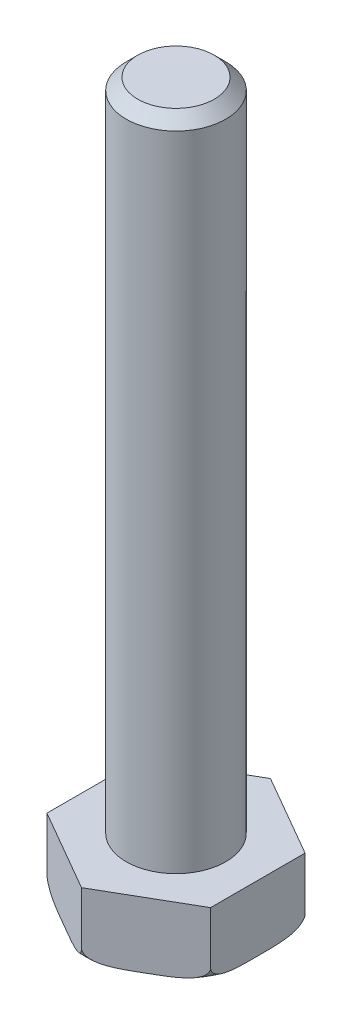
ISO-10303-21;
HEADER;
FILE_DESCRIPTION(('STEP AP214'),'2;1');
FILE_NAME('part.step','',(''),(''),'','','');
FILE_SCHEMA(('AUTOMOTIVE_DESIGN { 1 0 10303 214 1 1 1 1 }'));
ENDSEC;
DATA;
#1=APPLICATION_CONTEXT('core data for automotive mechanical design processes');
#2=APPLICATION_PROTOCOL_DEFINITION('international standard','automotive_design',2000,#1);
#3=PRODUCT_CONTEXT('',#1,'mechanical');
#4=PRODUCT('Part','Part','',(#3));
#5=PRODUCT_RELATED_PRODUCT_CATEGORY('part','',(#4));
#6=PRODUCT_DEFINITION_FORMATION('','',#4);
#7=PRODUCT_DEFINITION_CONTEXT('part definition',#1,'design');
#8=PRODUCT_DEFINITION('design','',#6,#7);
#9=PRODUCT_DEFINITION_SHAPE('','',#8);
#10=(LENGTH_UNIT() NAMED_UNIT(*) SI_UNIT(.MILLI.,.METRE.));
#11=(NAMED_UNIT(*) PLANE_ANGLE_UNIT() SI_UNIT($,.RADIAN.));
#12=(NAMED_UNIT(*) SI_UNIT($,.STERADIAN.) SOLID_ANGLE_UNIT());
#13=UNCERTAINTY_MEASURE_WITH_UNIT(LENGTH_MEASURE(1.E-05),#10,'distance_accuracy_value','');
#14=(GEOMETRIC_REPRESENTATION_CONTEXT(3) GLOBAL_UNCERTAINTY_ASSIGNED_CONTEXT((#13)) GLOBAL_UNIT_ASSIGNED_CONTEXT((#10,
#11,#12)) REPRESENTATION_CONTEXT('',''));
#15=CARTESIAN_POINT('',(0.,0.,0.));
#16=DIRECTION('',(0.,0.,1.));
#17=DIRECTION('',(1.,0.,0.));
#18=AXIS2_PLACEMENT_3D('',#15,#16,#17);
#19=CARTESIAN_POINT('',(0.,-11.3583659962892,19.2633276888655));
#20=DIRECTION('',(0.,1.,0.));
#21=DIRECTION('',(0.,0.,1.));
#22=AXIS2_PLACEMENT_3D('',#19,#20,#21);
#23=PLANE('',#22);
#24=CARTESIAN_POINT('',(0.,-11.3583659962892,23.8460454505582));
#25=DIRECTION('',(0.,-1.,0.));
#26=DIRECTION('',(0.,0.,-1.));
#27=AXIS2_PLACEMENT_3D('',#24,#25,#26);
#28=CIRCLE('',#27,3.94771776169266);
#29=CARTESIAN_POINT('',(0.,-11.3583659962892,19.8983276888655));
#30=VERTEX_POINT('',#29);
#31=EDGE_CURVE('E22',#30,#30,#28,.F.);
#32=ORIENTED_EDGE('',*,*,#31,.F.);
#33=EDGE_LOOP('',(#32));
#34=FACE_BOUND('',#33,.T.);
#35=ADVANCED_FACE('F17',(#34),#23,.F.);
#36=CARTESIAN_POINT('',(0.,-10.7233659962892,23.8460454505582));
#37=DIRECTION('',(0.,-1.,0.));
#38=DIRECTION('',(0.,0.,-1.));
#39=AXIS2_PLACEMENT_3D('',#36,#37,#38);
#40=TOROIDAL_SURFACE('',#39,3.94771776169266,0.635);
#41=CARTESIAN_POINT('',(0.,-10.7233659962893,19.2633276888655));
#42=CARTESIAN_POINT('',(-3.83732688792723E-05,-10.7423802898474,19.2633055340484));
#43=CARTESIAN_POINT('',(0.00147685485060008,-10.7613470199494,19.2641803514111));
#44=CARTESIAN_POINT('',(0.00727990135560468,-10.7985464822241,19.2675307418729));
#45=CARTESIAN_POINT('',(0.0115439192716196,-10.8167841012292,19.2699925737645));
#46=CARTESIAN_POINT('',(0.022504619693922,-10.8521779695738,19.2763207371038));
#47=CARTESIAN_POINT('',(0.0291944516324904,-10.8693371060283,19.2801831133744));
#48=CARTESIAN_POINT('',(0.0445861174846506,-10.9024333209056,19.2890694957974));
#49=CARTESIAN_POINT('',(0.0532924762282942,-10.9183675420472,19.2940961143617));
#50=CARTESIAN_POINT('',(0.0785354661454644,-10.9589030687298,19.3086701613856));
#51=CARTESIAN_POINT('',(0.0964659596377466,-10.982346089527,19.31902233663));
#52=CARTESIAN_POINT('',(0.135238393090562,-11.0257503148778,19.3414076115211));
#53=CARTESIAN_POINT('',(0.156088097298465,-11.0457019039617,19.3534451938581));
#54=CARTESIAN_POINT('',(0.215571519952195,-11.0959638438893,19.3877879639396));
#55=CARTESIAN_POINT('',(0.25610593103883,-11.1232472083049,19.4111905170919));
#56=CARTESIAN_POINT('',(0.340045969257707,-11.1708989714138,19.4596533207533));
#57=CARTESIAN_POINT('',(0.383457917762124,-11.1912514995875,19.4847172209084));
#58=CARTESIAN_POINT('',(0.490169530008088,-11.2340920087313,19.5463271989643));
#59=CARTESIAN_POINT('',(0.554243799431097,-11.2539590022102,19.5833204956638));
#60=CARTESIAN_POINT('',(0.68378244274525,-11.2865374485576,19.6581096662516));
#61=CARTESIAN_POINT('',(0.749249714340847,-11.2992320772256,19.6959072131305));
#62=CARTESIAN_POINT('',(0.881045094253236,-11.3196748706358,19.7719993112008));
#63=CARTESIAN_POINT('',(0.947375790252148,-11.3273997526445,19.8102953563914));
#64=CARTESIAN_POINT('',(1.08027404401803,-11.3394445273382,19.8870241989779));
#65=CARTESIAN_POINT('',(1.14684168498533,-11.3437630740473,19.9254570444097));
#66=CARTESIAN_POINT('',(1.28891257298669,-11.3506527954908,20.0074817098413));
#67=CARTESIAN_POINT('',(1.36442595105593,-11.3529149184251,20.051079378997));
#68=CARTESIAN_POINT('',(1.51548672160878,-11.3559630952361,20.1382943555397));
#69=CARTESIAN_POINT('',(1.59103411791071,-11.3567487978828,20.1819116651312));
#70=CARTESIAN_POINT('',(1.74188055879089,-11.3577102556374,20.2690028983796));
#71=CARTESIAN_POINT('',(1.81717959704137,-11.3578880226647,20.3124768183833));
#72=CARTESIAN_POINT('',(1.96777145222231,-11.3580499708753,20.3994210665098));
#73=CARTESIAN_POINT('',(2.04306426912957,-11.3580341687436,20.4428913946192));
#74=CARTESIAN_POINT('',(2.22049431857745,-11.3577428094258,20.5453306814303));
#75=CARTESIAN_POINT('',(2.32263105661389,-11.3573766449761,20.6042993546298));
#76=CARTESIAN_POINT('',(2.52690364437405,-11.3548434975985,20.7222361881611));
#77=CARTESIAN_POINT('',(2.62903949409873,-11.3526765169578,20.7812043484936));
#78=CARTESIAN_POINT('',(2.80048926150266,-11.3450202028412,20.8801909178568));
#79=CARTESIAN_POINT('',(2.86984168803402,-11.3408167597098,20.9202315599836));
#80=CARTESIAN_POINT('',(3.0084780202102,-11.3288214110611,21.000273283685));
#81=CARTESIAN_POINT('',(3.07776153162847,-11.3210225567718,21.0402741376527));
#82=CARTESIAN_POINT('',(3.18625832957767,-11.3044847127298,21.1029147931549));
#83=CARTESIAN_POINT('',(3.22567711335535,-11.2975696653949,21.1256732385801));
#84=CARTESIAN_POINT('',(3.30416684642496,-11.2815012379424,21.1709893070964));
#85=CARTESIAN_POINT('',(3.34323790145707,-11.2723485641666,21.1935469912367));
#86=CARTESIAN_POINT('',(3.42068899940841,-11.2512872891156,21.238263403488));
#87=CARTESIAN_POINT('',(3.45907093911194,-11.2393881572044,21.2604232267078));
#88=CARTESIAN_POINT('',(3.53488731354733,-11.2121292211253,21.3041958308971));
#89=CARTESIAN_POINT('',(3.57232269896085,-11.1967730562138,21.3258091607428));
#90=CARTESIAN_POINT('',(3.63577808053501,-11.1664072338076,21.3624451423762));
#91=CARTESIAN_POINT('',(3.66216024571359,-11.1524152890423,21.3776768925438));
#92=CARTESIAN_POINT('',(3.71372930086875,-11.121617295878,21.4074503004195));
#93=CARTESIAN_POINT('',(3.73891464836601,-11.1048077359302,21.4219910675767));
#94=CARTESIAN_POINT('',(3.78763446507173,-11.0676926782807,21.4501194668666));
#95=CARTESIAN_POINT('',(3.81115197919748,-11.0473569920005,21.4636973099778));
#96=CARTESIAN_POINT('',(3.85520083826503,-11.0027163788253,21.4891289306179));
#97=CARTESIAN_POINT('',(3.87573886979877,-10.9784206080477,21.5009865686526));
#98=CARTESIAN_POINT('',(3.9052282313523,-10.9355586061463,21.5180122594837));
#99=CARTESIAN_POINT('',(3.91561842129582,-10.9183183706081,21.5240110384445));
#100=CARTESIAN_POINT('',(3.93403687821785,-10.8822736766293,21.5346449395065));
#101=CARTESIAN_POINT('',(3.94207264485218,-10.8634744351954,21.539284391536));
#102=CARTESIAN_POINT('',(3.95508099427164,-10.82492353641,21.546794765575));
#103=CARTESIAN_POINT('',(3.96011259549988,-10.8051990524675,21.5496997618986));
#104=CARTESIAN_POINT('',(3.96699119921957,-10.7648012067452,21.5536711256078));
#105=CARTESIAN_POINT('',(3.96880140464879,-10.7441196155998,21.5547162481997));
#106=CARTESIAN_POINT('',(3.96875000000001,-10.7233659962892,21.5546865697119));
#107=B_SPLINE_CURVE_WITH_KNOTS('',3,(#41,#42,#43,#44,#45,#46,#47,#48,#49,#50,#51,#52,#53,#54,
#55,#56,#57,#58,#59,#60,#61,#62,#63,#64,#65,#66,#67,#68,#69,#70,#71,#72,#73,#74,#75,#76,#77,#78,
#79,#80,#81,#82,#83,#84,#85,#86,#87,#88,#89,#90,#91,#92,#93,#94,#95,#96,#97,#98,#99,#100,#101,
#102,#103,#104,#105,#106),.UNSPECIFIED.,.F.,.F.,(4,2,2,2,2,2,2,2,2,2,2,2,2,2,2,2,2,2,2,2,2,2,2,
2,2,2,2,2,2,2,2,2,4),(0.,0.0568869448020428,0.113287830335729,0.16953066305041,
0.225900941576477,0.319189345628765,0.412730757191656,0.574340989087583,0.736318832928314,
0.965539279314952,1.19529519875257,1.42611980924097,1.65703558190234,1.91868392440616,
2.18039450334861,2.44123812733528,2.70205926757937,3.05587670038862,3.40969368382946,
3.65022622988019,3.89122560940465,4.02930090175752,4.16733266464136,4.30489544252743,
4.44231407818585,4.54277168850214,4.64335544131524,4.74484717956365,4.84610750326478,
4.90892939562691,4.97154894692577,5.03289395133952,5.09493529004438),.UNSPECIFIED.);
#108=CARTESIAN_POINT('',(0.,-10.7233659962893,19.2633276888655));
#109=VERTEX_POINT('',#108);
#110=CARTESIAN_POINT('',(3.96875000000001,-10.7233659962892,21.5546865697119));
#111=VERTEX_POINT('',#110);
#112=EDGE_CURVE('E75',#109,#111,#107,.T.);
#113=ORIENTED_EDGE('',*,*,#112,.T.);
#114=CARTESIAN_POINT('',(3.96875,-10.7233659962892,21.5546865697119));
#115=CARTESIAN_POINT('',(3.96875,-10.7423803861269,21.5546422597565));
#116=CARTESIAN_POINT('',(3.96875,-10.7613472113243,21.5563919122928));
#117=CARTESIAN_POINT('',(3.96875,-10.7985466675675,21.5630927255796));
#118=CARTESIAN_POINT('',(3.96875,-10.8167841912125,21.5680163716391));
#119=CARTESIAN_POINT('',(3.96875,-10.8521778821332,21.5806726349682));
#120=CARTESIAN_POINT('',(3.96875,-10.8693369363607,21.5883973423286));
#121=CARTESIAN_POINT('',(3.96875,-10.90243316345,21.6061700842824));
#122=CARTESIAN_POINT('',(3.96875,-10.918367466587,21.6162233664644));
#123=CARTESIAN_POINT('',(3.96875,-10.958903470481,21.6453718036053));
#124=CARTESIAN_POINT('',(3.96875,-10.9823468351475,21.666076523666));
#125=CARTESIAN_POINT('',(3.96875,-11.0257509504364,21.7108471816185));
#126=CARTESIAN_POINT('',(3.96875,-11.0457021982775,21.734921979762));
#127=CARTESIAN_POINT('',(3.96875,-11.0959619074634,21.8036044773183));
#128=CARTESIAN_POINT('',(3.96875,-11.1232438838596,21.8504065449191));
#129=CARTESIAN_POINT('',(3.96875,-11.1708964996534,21.9473317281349));
#130=CARTESIAN_POINT('',(3.96875000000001,-11.1912504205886,21.9974625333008));
#131=CARTESIAN_POINT('',(3.96875000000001,-11.2340980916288,22.120703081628));
#132=CARTESIAN_POINT('',(3.96875000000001,-11.2539686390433,22.1947080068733));
#133=CARTESIAN_POINT('',(3.96875000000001,-11.2865514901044,22.3443233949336));
#134=CARTESIAN_POINT('',(3.96875000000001,-11.2992469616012,22.4199372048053));
#135=CARTESIAN_POINT('',(3.96875000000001,-11.3196847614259,22.572122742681));
#136=CARTESIAN_POINT('',(3.96875000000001,-11.3274061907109,22.6486971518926));
#137=CARTESIAN_POINT('',(3.96875000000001,-11.3394470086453,22.8021179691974));
#138=CARTESIAN_POINT('',(3.96875000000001,-11.3437651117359,22.8789644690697));
#139=CARTESIAN_POINT('',(3.96875000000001,-11.3501088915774,23.0300721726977));
#140=CARTESIAN_POINT('',(3.96875000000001,-11.3522089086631,23.1043305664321));
#141=CARTESIAN_POINT('',(3.96875000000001,-11.3552091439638,23.2528829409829));
#142=CARTESIAN_POINT('',(3.96875000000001,-11.3561091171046,23.3271769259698));
#143=CARTESIAN_POINT('',(3.96875000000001,-11.3573056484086,23.4755669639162));
#144=CARTESIAN_POINT('',(3.96875000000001,-11.3576038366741,23.54966300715));
#145=CARTESIAN_POINT('',(3.96875000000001,-11.3579580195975,23.6978545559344));
#146=CARTESIAN_POINT('',(3.96875000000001,-11.3580140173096,23.7719500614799));
#147=CARTESIAN_POINT('',(3.96875000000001,-11.3580227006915,23.9520558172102));
#148=CARTESIAN_POINT('',(3.96875000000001,-11.3579204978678,24.0580659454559));
#149=CARTESIAN_POINT('',(3.96875000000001,-11.3570158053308,24.270123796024));
#150=CARTESIAN_POINT('',(3.96875000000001,-11.3562130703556,24.376171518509));
#151=CARTESIAN_POINT('',(3.96875000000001,-11.3524015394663,24.5880581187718));
#152=CARTESIAN_POINT('',(3.96875000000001,-11.3493964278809,24.6938970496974));
#153=CARTESIAN_POINT('',(3.96875000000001,-11.3387448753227,24.9053202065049));
#154=CARTESIAN_POINT('',(3.96875000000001,-11.3311020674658,25.0109045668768));
#155=CARTESIAN_POINT('',(3.96875000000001,-11.312602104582,25.175757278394));
#156=CARTESIAN_POINT('',(3.96875000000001,-11.3045606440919,25.2353260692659));
#157=CARTESIAN_POINT('',(3.96875000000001,-11.2848233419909,25.3540209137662));
#158=CARTESIAN_POINT('',(3.96875000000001,-11.2731180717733,25.4131454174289));
#159=CARTESIAN_POINT('',(3.96875000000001,-11.2423357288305,25.540732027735));
#160=CARTESIAN_POINT('',(3.96875000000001,-11.2223186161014,25.6089875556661));
#161=CARTESIAN_POINT('',(3.96875000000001,-11.1851610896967,25.7085882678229));
#162=CARTESIAN_POINT('',(3.96875000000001,-11.1716165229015,25.7412699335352));
#163=CARTESIAN_POINT('',(3.96875000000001,-11.1416619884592,25.8052778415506));
#164=CARTESIAN_POINT('',(3.96875000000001,-11.125255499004,25.8366056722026));
#165=CARTESIAN_POINT('',(3.96875000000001,-11.0928669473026,25.8907462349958));
#166=CARTESIAN_POINT('',(3.96875000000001,-11.0775421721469,25.9139489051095));
#167=CARTESIAN_POINT('',(3.96875000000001,-11.0444119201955,25.9585810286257));
#168=CARTESIAN_POINT('',(3.96875000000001,-11.026603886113,25.9800086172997));
#169=CARTESIAN_POINT('',(3.96875000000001,-10.9879985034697,26.0204860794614));
#170=CARTESIAN_POINT('',(3.96875000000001,-10.9671703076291,26.0395070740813));
#171=CARTESIAN_POINT('',(3.96875000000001,-10.9225111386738,26.0736448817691));
#172=CARTESIAN_POINT('',(3.96875000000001,-10.8986880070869,26.0887715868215));
#173=CARTESIAN_POINT('',(3.96875000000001,-10.8563252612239,26.1096440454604));
#174=CARTESIAN_POINT('',(3.96875000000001,-10.8385036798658,26.1168435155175));
#175=CARTESIAN_POINT('',(3.96875000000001,-10.8019316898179,26.128174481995));
#176=CARTESIAN_POINT('',(3.96875000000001,-10.7831837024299,26.132313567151));
#177=CARTESIAN_POINT('',(3.96875000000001,-10.7506796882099,26.136527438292));
#178=CARTESIAN_POINT('',(3.96875000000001,-10.7370256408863,26.1374249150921));
#179=CARTESIAN_POINT('',(3.96875000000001,-10.7233659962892,26.1374043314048));
#180=B_SPLINE_CURVE_WITH_KNOTS('',3,(#114,#115,#116,#117,#118,#119,#120,#121,#122,#123,#124,
#125,#126,#127,#128,#129,#130,#131,#132,#133,#134,#135,#136,#137,#138,#139,#140,#141,#142,#143,
#144,#145,#146,#147,#148,#149,#150,#151,#152,#153,#154,#155,#156,#157,#158,#159,#160,#161,#162,
#163,#164,#165,#166,#167,#168,#169,#170,#171,#172,#173,#174,#175,#176,#177,#178,#179),
.UNSPECIFIED.,.F.,.F.,(4,2,2,2,2,2,2,2,2,2,2,2,2,2,2,2,2,2,2,2,2,2,2,2,2,2,2,2,2,2,2,2,4),(0.,
0.0568872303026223,0.113287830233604,0.16953038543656,0.2259009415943,0.319190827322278,
0.412730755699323,0.574331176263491,0.736318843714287,0.965594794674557,1.19540639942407,
1.4261773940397,1.65703551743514,1.87988372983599,2.10277744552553,2.32506657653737,
2.54735290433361,2.86538423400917,3.18352695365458,3.50113866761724,3.81850188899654,
3.99873946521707,4.17944473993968,4.39224398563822,4.49827292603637,4.60417389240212,
4.68746407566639,4.77084067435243,4.85513825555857,4.93921954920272,4.99665610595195,
5.05394975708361,5.09489579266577),.UNSPECIFIED.);
#181=CARTESIAN_POINT('',(3.96875000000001,-10.7233659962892,26.1374043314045));
#182=VERTEX_POINT('',#181);
#183=EDGE_CURVE('E68',#111,#182,#180,.T.);
#184=ORIENTED_EDGE('',*,*,#183,.T.);
#185=CARTESIAN_POINT('',(3.96875000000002,-10.7233659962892,26.1374043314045));
#186=CARTESIAN_POINT('',(3.96878837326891,-10.7423802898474,26.1373821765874));
#187=CARTESIAN_POINT('',(3.96727314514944,-10.7613470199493,26.1382569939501));
#188=CARTESIAN_POINT('',(3.96147009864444,-10.7985464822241,26.1416073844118));
#189=CARTESIAN_POINT('',(3.95720608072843,-10.8167841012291,26.1440692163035));
#190=CARTESIAN_POINT('',(3.94624538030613,-10.8521779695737,26.1503973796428));
#191=CARTESIAN_POINT('',(3.93955554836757,-10.8693371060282,26.1542597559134));
#192=CARTESIAN_POINT('',(3.92416388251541,-10.9024333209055,26.1631461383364));
#193=CARTESIAN_POINT('',(3.91545752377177,-10.9183675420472,26.1681727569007));
#194=CARTESIAN_POINT('',(3.89021453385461,-10.9589030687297,26.1827468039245));
#195=CARTESIAN_POINT('',(3.87228404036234,-10.9823460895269,26.193098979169));
#196=CARTESIAN_POINT('',(3.83351160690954,-11.0257503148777,26.2154842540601));
#197=CARTESIAN_POINT('',(3.81266190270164,-11.0457019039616,26.227521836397));
#198=CARTESIAN_POINT('',(3.75317848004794,-11.0959638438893,26.2618646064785));
#199=CARTESIAN_POINT('',(3.71264406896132,-11.1232472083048,26.2852671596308));
#200=CARTESIAN_POINT('',(3.62870403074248,-11.1708989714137,26.3337299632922));
#201=CARTESIAN_POINT('',(3.58529208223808,-11.1912514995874,26.3587938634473));
#202=CARTESIAN_POINT('',(3.47858046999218,-11.2340920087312,26.4204038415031));
#203=CARTESIAN_POINT('',(3.41450620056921,-11.2539590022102,26.4573971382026));
#204=CARTESIAN_POINT('',(3.28496755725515,-11.2865374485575,26.5321863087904));
#205=CARTESIAN_POINT('',(3.2195002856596,-11.2992320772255,26.5699838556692));
#206=CARTESIAN_POINT('',(3.0877049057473,-11.3196748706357,26.6460759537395));
#207=CARTESIAN_POINT('',(3.02137420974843,-11.3273997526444,26.68437199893));
#208=CARTESIAN_POINT('',(2.88847595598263,-11.3394445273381,26.7611008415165));
#209=CARTESIAN_POINT('',(2.82190831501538,-11.3437630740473,26.7995336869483));
#210=CARTESIAN_POINT('',(2.67983742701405,-11.3506527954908,26.8815583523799));
#211=CARTESIAN_POINT('',(2.60432404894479,-11.352914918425,26.9251560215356));
#212=CARTESIAN_POINT('',(2.4532632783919,-11.3559630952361,27.0123709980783));
#213=CARTESIAN_POINT('',(2.37771588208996,-11.3567487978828,27.0559883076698));
#214=CARTESIAN_POINT('',(2.22686944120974,-11.3577102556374,27.1430795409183));
#215=CARTESIAN_POINT('',(2.15157040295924,-11.3578880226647,27.1865534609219));
#216=CARTESIAN_POINT('',(2.00097854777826,-11.3580499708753,27.2734977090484));
#217=CARTESIAN_POINT('',(1.92568573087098,-11.3580341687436,27.3169680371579));
#218=CARTESIAN_POINT('',(1.74825568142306,-11.3577428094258,27.419407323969));
#219=CARTESIAN_POINT('',(1.64611894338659,-11.3573766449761,27.4783759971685));
#220=CARTESIAN_POINT('',(1.44184635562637,-11.3548434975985,27.5963128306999));
#221=CARTESIAN_POINT('',(1.33971050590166,-11.3526765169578,27.6552809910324));
#222=CARTESIAN_POINT('',(1.16826073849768,-11.3450202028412,27.7542675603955));
#223=CARTESIAN_POINT('',(1.09890831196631,-11.3408167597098,27.7943082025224));
#224=CARTESIAN_POINT('',(0.96027197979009,-11.3288214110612,27.8743499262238));
#225=CARTESIAN_POINT('',(0.890988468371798,-11.3210225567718,27.9143507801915));
#226=CARTESIAN_POINT('',(0.78249167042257,-11.3044847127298,27.9769914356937));
#227=CARTESIAN_POINT('',(0.743072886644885,-11.2975696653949,27.9997498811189));
#228=CARTESIAN_POINT('',(0.664583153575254,-11.2815012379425,28.0450659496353));
#229=CARTESIAN_POINT('',(0.625512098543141,-11.2723485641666,28.0676236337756));
#230=CARTESIAN_POINT('',(0.548061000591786,-11.2512872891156,28.1123400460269));
#231=CARTESIAN_POINT('',(0.509679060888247,-11.2393881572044,28.1344998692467));
#232=CARTESIAN_POINT('',(0.433862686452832,-11.2121292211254,28.178272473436));
#233=CARTESIAN_POINT('',(0.396427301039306,-11.1967730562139,28.1998858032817));
#234=CARTESIAN_POINT('',(0.332971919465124,-11.1664072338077,28.2365217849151));
#235=CARTESIAN_POINT('',(0.30658975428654,-11.1524152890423,28.2517535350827));
#236=CARTESIAN_POINT('',(0.255020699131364,-11.1216172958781,28.2815269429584));
#237=CARTESIAN_POINT('',(0.2298353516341,-11.1048077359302,28.2960677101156));
#238=CARTESIAN_POINT('',(0.181115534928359,-11.0676926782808,28.3241961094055));
#239=CARTESIAN_POINT('',(0.157598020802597,-11.0473569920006,28.3377739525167));
#240=CARTESIAN_POINT('',(0.113549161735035,-11.0027163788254,28.3632055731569));
#241=CARTESIAN_POINT('',(0.0930111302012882,-10.9784206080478,28.3750632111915));
#242=CARTESIAN_POINT('',(0.0635217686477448,-10.9355586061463,28.3920889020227));
#243=CARTESIAN_POINT('',(0.0531315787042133,-10.9183183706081,28.3980876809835));
#244=CARTESIAN_POINT('',(0.0347131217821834,-10.8822736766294,28.4087215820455));
#245=CARTESIAN_POINT('',(0.0266773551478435,-10.8634744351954,28.413361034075));
#246=CARTESIAN_POINT('',(0.0136690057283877,-10.8249235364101,28.420871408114));
#247=CARTESIAN_POINT('',(0.00863740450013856,-10.8051990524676,28.4237764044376));
#248=CARTESIAN_POINT('',(0.00175880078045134,-10.7648012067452,28.4277477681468));
#249=CARTESIAN_POINT('',(-5.14046487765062E-05,-10.7441196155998,28.4287928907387));
#250=CARTESIAN_POINT('',(0.,-10.7233659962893,28.4287632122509));
#251=B_SPLINE_CURVE_WITH_KNOTS('',3,(#185,#186,#187,#188,#189,#190,#191,#192,#193,#194,#195,
#196,#197,#198,#199,#200,#201,#202,#203,#204,#205,#206,#207,#208,#209,#210,#211,#212,#213,#214,
#215,#216,#217,#218,#219,#220,#221,#222,#223,#224,#225,#226,#227,#228,#229,#230,#231,#232,#233,
#234,#235,#236,#237,#238,#239,#240,#241,#242,#243,#244,#245,#246,#247,#248,#249,#250),
.UNSPECIFIED.,.F.,.F.,(4,2,2,2,2,2,2,2,2,2,2,2,2,2,2,2,2,2,2,2,2,2,2,2,2,2,2,2,2,2,2,2,4),(0.,
0.0568869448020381,0.113287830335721,0.169530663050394,0.225900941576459,0.319189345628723,
0.412730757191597,0.57434098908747,0.736318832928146,0.965539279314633,1.19529519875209,
1.42611980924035,1.65703558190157,1.91868392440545,2.18039450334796,2.44123812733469,
2.70205926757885,3.0558767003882,3.40969368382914,3.65022622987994,3.89122560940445,
4.02930090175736,4.16733266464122,4.30489544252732,4.44231407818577,4.54277168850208,
4.64335544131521,4.74484717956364,4.8461075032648,4.90892939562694,4.97154894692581,
5.03289395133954,5.09493529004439),.UNSPECIFIED.);
#252=CARTESIAN_POINT('',(0.,-10.7233659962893,28.4287632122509));
#253=VERTEX_POINT('',#252);
#254=EDGE_CURVE('E72',#182,#253,#251,.T.);
#255=ORIENTED_EDGE('',*,*,#254,.T.);
#256=CARTESIAN_POINT('',(0.,-10.7233659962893,28.4287632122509));
#257=CARTESIAN_POINT('',(3.83732689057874E-05,-10.7423802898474,28.428785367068));
#258=CARTESIAN_POINT('',(-0.0014768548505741,-10.7613470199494,28.4279105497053));
#259=CARTESIAN_POINT('',(-0.00727990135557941,-10.7985464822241,28.4245601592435));
#260=CARTESIAN_POINT('',(-0.0115439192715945,-10.8167841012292,28.4220983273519));
#261=CARTESIAN_POINT('',(-0.0225046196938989,-10.8521779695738,28.4157701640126));
#262=CARTESIAN_POINT('',(-0.029194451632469,-10.8693371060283,28.411907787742));
#263=CARTESIAN_POINT('',(-0.0445861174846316,-10.9024333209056,28.403021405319));
#264=CARTESIAN_POINT('',(-0.053292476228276,-10.9183675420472,28.3979947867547));
#265=CARTESIAN_POINT('',(-0.0785354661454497,-10.9589030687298,28.3834207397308));
#266=CARTESIAN_POINT('',(-0.0964659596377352,-10.982346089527,28.3730685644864));
#267=CARTESIAN_POINT('',(-0.135238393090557,-11.0257503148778,28.3506832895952));
#268=CARTESIAN_POINT('',(-0.156088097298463,-11.0457019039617,28.3386457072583));
#269=CARTESIAN_POINT('',(-0.215571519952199,-11.0959638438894,28.3043029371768));
#270=CARTESIAN_POINT('',(-0.25610593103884,-11.1232472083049,28.2809003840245));
#271=CARTESIAN_POINT('',(-0.340045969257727,-11.1708989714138,28.2324375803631));
#272=CARTESIAN_POINT('',(-0.38345791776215,-11.1912514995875,28.207373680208));
#273=CARTESIAN_POINT('',(-0.490169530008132,-11.2340920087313,28.1457637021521));
#274=CARTESIAN_POINT('',(-0.554243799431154,-11.2539590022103,28.1087704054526));
#275=CARTESIAN_POINT('',(-0.683782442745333,-11.2865374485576,28.0339812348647));
#276=CARTESIAN_POINT('',(-0.749249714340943,-11.2992320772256,27.9961836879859));
#277=CARTESIAN_POINT('',(-0.881045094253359,-11.3196748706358,27.9200915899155));
#278=CARTESIAN_POINT('',(-0.947375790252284,-11.3273997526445,27.881795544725));
#279=CARTESIAN_POINT('',(-1.0802740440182,-11.3394445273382,27.8050667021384));
#280=CARTESIAN_POINT('',(-1.14684168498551,-11.3437630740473,27.7666338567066));
#281=CARTESIAN_POINT('',(-1.28891257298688,-11.3506527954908,27.684609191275));
#282=CARTESIAN_POINT('',(-1.36442595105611,-11.3529149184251,27.6410115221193));
#283=CARTESIAN_POINT('',(-1.51548672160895,-11.3559630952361,27.5537965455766));
#284=CARTESIAN_POINT('',(-1.59103411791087,-11.3567487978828,27.5101792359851));
#285=CARTESIAN_POINT('',(-1.74188055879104,-11.3577102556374,27.4230880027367));
#286=CARTESIAN_POINT('',(-1.81717959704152,-11.3578880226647,27.379614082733));
#287=CARTESIAN_POINT('',(-1.96777145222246,-11.3580499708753,27.2926698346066));
#288=CARTESIAN_POINT('',(-2.04306426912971,-11.3580341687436,27.2491995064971));
#289=CARTESIAN_POINT('',(-2.22049431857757,-11.3577428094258,27.1467602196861));
#290=CARTESIAN_POINT('',(-2.32263105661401,-11.357376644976,27.0877915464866));
#291=CARTESIAN_POINT('',(-2.52690364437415,-11.3548434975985,26.9698547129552));
#292=CARTESIAN_POINT('',(-2.62903949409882,-11.3526765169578,26.9108865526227));
#293=CARTESIAN_POINT('',(-2.80048926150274,-11.3450202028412,26.8118999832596));
#294=CARTESIAN_POINT('',(-2.86984168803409,-11.3408167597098,26.7718593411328));
#295=CARTESIAN_POINT('',(-3.00847802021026,-11.3288214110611,26.6918176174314));
#296=CARTESIAN_POINT('',(-3.07776153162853,-11.3210225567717,26.6518167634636));
#297=CARTESIAN_POINT('',(-3.18625832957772,-11.3044847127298,26.5891761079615));
#298=CARTESIAN_POINT('',(-3.2256771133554,-11.2975696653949,26.5664176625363));
#299=CARTESIAN_POINT('',(-3.30416684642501,-11.2815012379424,26.5211015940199));
#300=CARTESIAN_POINT('',(-3.34323790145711,-11.2723485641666,26.4985439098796));
#301=CARTESIAN_POINT('',(-3.42068899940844,-11.2512872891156,26.4538274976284));
#302=CARTESIAN_POINT('',(-3.45907093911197,-11.2393881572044,26.4316676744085));
#303=CARTESIAN_POINT('',(-3.53488731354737,-11.2121292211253,26.3878950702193));
#304=CARTESIAN_POINT('',(-3.57232269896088,-11.1967730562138,26.3662817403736));
#305=CARTESIAN_POINT('',(-3.63577808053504,-11.1664072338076,26.3296457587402));
#306=CARTESIAN_POINT('',(-3.66216024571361,-11.1524152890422,26.3144140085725));
#307=CARTESIAN_POINT('',(-3.71372930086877,-11.121617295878,26.2846406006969));
#308=CARTESIAN_POINT('',(-3.73891464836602,-11.1048077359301,26.2700998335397));
#309=CARTESIAN_POINT('',(-3.78763446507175,-11.0676926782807,26.2419714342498));
#310=CARTESIAN_POINT('',(-3.8111519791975,-11.0473569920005,26.2283935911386));
#311=CARTESIAN_POINT('',(-3.85520083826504,-11.0027163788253,26.2029619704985));
#312=CARTESIAN_POINT('',(-3.87573886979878,-10.9784206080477,26.1911043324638));
#313=CARTESIAN_POINT('',(-3.90522823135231,-10.9355586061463,26.1740786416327));
#314=CARTESIAN_POINT('',(-3.91561842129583,-10.9183183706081,26.1680798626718));
#315=CARTESIAN_POINT('',(-3.93403687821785,-10.8822736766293,26.1574459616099));
#316=CARTESIAN_POINT('',(-3.94207264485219,-10.8634744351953,26.1528065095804));
#317=CARTESIAN_POINT('',(-3.95508099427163,-10.82492353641,26.1452961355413));
#318=CARTESIAN_POINT('',(-3.96011259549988,-10.8051990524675,26.1423911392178));
#319=CARTESIAN_POINT('',(-3.96699119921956,-10.7648012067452,26.1384197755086));
#320=CARTESIAN_POINT('',(-3.96880140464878,-10.7441196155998,26.1373746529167));
#321=CARTESIAN_POINT('',(-3.96875,-10.7233659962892,26.1374043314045));
#322=B_SPLINE_CURVE_WITH_KNOTS('',3,(#256,#257,#258,#259,#260,#261,#262,#263,#264,#265,#266,
#267,#268,#269,#270,#271,#272,#273,#274,#275,#276,#277,#278,#279,#280,#281,#282,#283,#284,#285,
#286,#287,#288,#289,#290,#291,#292,#293,#294,#295,#296,#297,#298,#299,#300,#301,#302,#303,#304,
#305,#306,#307,#308,#309,#310,#311,#312,#313,#314,#315,#316,#317,#318,#319,#320,#321),
.UNSPECIFIED.,.F.,.F.,(4,2,2,2,2,2,2,2,2,2,2,2,2,2,2,2,2,2,2,2,2,2,2,2,2,2,2,2,2,2,2,2,4),(0.,
0.0568869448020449,0.113287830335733,0.169530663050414,0.225900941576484,0.31918934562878,
0.412730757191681,0.574340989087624,0.736318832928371,0.965539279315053,1.19529519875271,
1.42611980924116,1.65703558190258,1.91868392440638,2.18039450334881,2.44123812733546,
2.70205926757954,3.05587670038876,3.40969368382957,3.65022622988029,3.89122560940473,
4.0293009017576,4.16733266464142,4.30489544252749,4.4423140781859,4.54277168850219,
4.64335544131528,4.74484717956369,4.84610750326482,4.90892939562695,4.97154894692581,
5.03289395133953,5.09493529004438),.UNSPECIFIED.);
#323=CARTESIAN_POINT('',(-3.96874999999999,-10.7233659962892,26.1374043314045));
#324=VERTEX_POINT('',#323);
#325=EDGE_CURVE('E131',#253,#324,#322,.T.);
#326=ORIENTED_EDGE('',*,*,#325,.T.);
#327=CARTESIAN_POINT('',(-3.96874999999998,-10.7233659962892,26.1374043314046));
#328=CARTESIAN_POINT('',(-3.96874999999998,-10.7423803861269,26.1374486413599));
#329=CARTESIAN_POINT('',(-3.96874999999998,-10.7613472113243,26.1356989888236));
#330=CARTESIAN_POINT('',(-3.96874999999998,-10.7985466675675,26.1289981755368));
#331=CARTESIAN_POINT('',(-3.96874999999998,-10.8167841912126,26.1240745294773));
#332=CARTESIAN_POINT('',(-3.96874999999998,-10.8521778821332,26.1114182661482));
#333=CARTESIAN_POINT('',(-3.96874999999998,-10.8693369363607,26.1036935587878));
#334=CARTESIAN_POINT('',(-3.96874999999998,-10.90243316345,26.085920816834));
#335=CARTESIAN_POINT('',(-3.96874999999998,-10.9183674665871,26.075867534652));
#336=CARTESIAN_POINT('',(-3.96874999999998,-10.958903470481,26.0467190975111));
#337=CARTESIAN_POINT('',(-3.96874999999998,-10.9823468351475,26.0260143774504));
#338=CARTESIAN_POINT('',(-3.96874999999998,-11.0257509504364,25.9812437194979));
#339=CARTESIAN_POINT('',(-3.96874999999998,-11.0457021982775,25.9571689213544));
#340=CARTESIAN_POINT('',(-3.96874999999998,-11.0959619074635,25.8884864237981));
#341=CARTESIAN_POINT('',(-3.96874999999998,-11.1232438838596,25.8416843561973));
#342=CARTESIAN_POINT('',(-3.96874999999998,-11.1708964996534,25.7447591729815));
#343=CARTESIAN_POINT('',(-3.96874999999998,-11.1912504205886,25.6946283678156));
#344=CARTESIAN_POINT('',(-3.96874999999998,-11.2340980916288,25.5713878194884));
#345=CARTESIAN_POINT('',(-3.96874999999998,-11.2539686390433,25.4973828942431));
#346=CARTESIAN_POINT('',(-3.96874999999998,-11.2865514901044,25.3477675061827));
#347=CARTESIAN_POINT('',(-3.96874999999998,-11.2992469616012,25.272153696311));
#348=CARTESIAN_POINT('',(-3.96874999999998,-11.3196847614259,25.1199681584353));
#349=CARTESIAN_POINT('',(-3.96874999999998,-11.3274061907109,25.0433937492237));
#350=CARTESIAN_POINT('',(-3.96874999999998,-11.3394470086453,24.8899729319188));
#351=CARTESIAN_POINT('',(-3.96874999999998,-11.3437651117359,24.8131264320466));
#352=CARTESIAN_POINT('',(-3.96874999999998,-11.3501088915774,24.6620187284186));
#353=CARTESIAN_POINT('',(-3.96874999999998,-11.3522089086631,24.5877603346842));
#354=CARTESIAN_POINT('',(-3.96874999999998,-11.3552091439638,24.4392079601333));
#355=CARTESIAN_POINT('',(-3.96874999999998,-11.3561091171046,24.3649139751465));
#356=CARTESIAN_POINT('',(-3.96874999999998,-11.3573056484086,24.2165239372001));
#357=CARTESIAN_POINT('',(-3.96874999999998,-11.3576038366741,24.1424278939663));
#358=CARTESIAN_POINT('',(-3.96874999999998,-11.3579580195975,23.994236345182));
#359=CARTESIAN_POINT('',(-3.96874999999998,-11.3580140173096,23.9201408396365));
#360=CARTESIAN_POINT('',(-3.96874999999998,-11.3580227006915,23.7400350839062));
#361=CARTESIAN_POINT('',(-3.96874999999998,-11.3579204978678,23.6340249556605));
#362=CARTESIAN_POINT('',(-3.96874999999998,-11.3570158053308,23.4219671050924));
#363=CARTESIAN_POINT('',(-3.96874999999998,-11.3562130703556,23.3159193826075));
#364=CARTESIAN_POINT('',(-3.96874999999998,-11.3524015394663,23.1040327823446));
#365=CARTESIAN_POINT('',(-3.96874999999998,-11.3493964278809,22.998193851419));
#366=CARTESIAN_POINT('',(-3.96874999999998,-11.3387448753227,22.7867706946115));
#367=CARTESIAN_POINT('',(-3.96874999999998,-11.3311020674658,22.6811863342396));
#368=CARTESIAN_POINT('',(-3.96874999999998,-11.312602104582,22.5163336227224));
#369=CARTESIAN_POINT('',(-3.96874999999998,-11.3045606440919,22.4567648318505));
#370=CARTESIAN_POINT('',(-3.96874999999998,-11.2848233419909,22.3380699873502));
#371=CARTESIAN_POINT('',(-3.96874999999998,-11.2731180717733,22.2789454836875));
#372=CARTESIAN_POINT('',(-3.96874999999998,-11.2423357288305,22.1513588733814));
#373=CARTESIAN_POINT('',(-3.96874999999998,-11.2223186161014,22.0831033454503));
#374=CARTESIAN_POINT('',(-3.96874999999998,-11.1851610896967,21.9835026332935));
#375=CARTESIAN_POINT('',(-3.96874999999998,-11.1716165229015,21.9508209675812));
#376=CARTESIAN_POINT('',(-3.96874999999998,-11.1416619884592,21.8868130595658));
#377=CARTESIAN_POINT('',(-3.96874999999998,-11.125255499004,21.8554852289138));
#378=CARTESIAN_POINT('',(-3.96874999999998,-11.0928669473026,21.8013446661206));
#379=CARTESIAN_POINT('',(-3.96874999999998,-11.0775421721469,21.7781419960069));
#380=CARTESIAN_POINT('',(-3.96874999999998,-11.0444119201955,21.7335098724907));
#381=CARTESIAN_POINT('',(-3.96874999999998,-11.026603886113,21.7120822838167));
#382=CARTESIAN_POINT('',(-3.96874999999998,-10.9879985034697,21.671604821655));
#383=CARTESIAN_POINT('',(-3.96874999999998,-10.9671703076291,21.6525838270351));
#384=CARTESIAN_POINT('',(-3.96874999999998,-10.9225111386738,21.6184460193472));
#385=CARTESIAN_POINT('',(-3.96874999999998,-10.8986880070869,21.6033193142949));
#386=CARTESIAN_POINT('',(-3.96874999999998,-10.8563252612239,21.582446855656));
#387=CARTESIAN_POINT('',(-3.96874999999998,-10.8385036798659,21.5752473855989));
#388=CARTESIAN_POINT('',(-3.96874999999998,-10.8019316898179,21.5639164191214));
#389=CARTESIAN_POINT('',(-3.96874999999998,-10.7831837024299,21.5597773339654));
#390=CARTESIAN_POINT('',(-3.96874999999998,-10.7506796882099,21.5555634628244));
#391=CARTESIAN_POINT('',(-3.96874999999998,-10.7370256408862,21.5546659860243));
#392=CARTESIAN_POINT('',(-3.96874999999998,-10.7233659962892,21.5546865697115));
#393=B_SPLINE_CURVE_WITH_KNOTS('',3,(#327,#328,#329,#330,#331,#332,#333,#334,#335,#336,#337,
#338,#339,#340,#341,#342,#343,#344,#345,#346,#347,#348,#349,#350,#351,#352,#353,#354,#355,#356,
#357,#358,#359,#360,#361,#362,#363,#364,#365,#366,#367,#368,#369,#370,#371,#372,#373,#374,#375,
#376,#377,#378,#379,#380,#381,#382,#383,#384,#385,#386,#387,#388,#389,#390,#391,#392),
.UNSPECIFIED.,.F.,.F.,(4,2,2,2,2,2,2,2,2,2,2,2,2,2,2,2,2,2,2,2,2,2,2,2,2,2,2,2,2,2,2,2,4),(0.,
0.0568872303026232,0.113287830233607,0.169530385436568,0.225900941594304,0.319190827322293,
0.412730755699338,0.574331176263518,0.736318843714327,0.965594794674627,1.19540639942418,
1.42617739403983,1.65703551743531,1.87988372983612,2.10277744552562,2.32506657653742,
2.54735290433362,2.86538423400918,3.18352695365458,3.50113866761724,3.81850188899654,
3.99873946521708,4.17944473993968,4.39224398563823,4.49827292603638,4.60417389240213,
4.6874640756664,4.77084067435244,4.85513825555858,4.93921954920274,4.99665610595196,
5.05394975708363,5.09489579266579),.UNSPECIFIED.);
#394=CARTESIAN_POINT('',(-3.96874999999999,-10.7233659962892,21.5546865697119));
#395=VERTEX_POINT('',#394);
#396=EDGE_CURVE('E138',#324,#395,#393,.T.);
#397=ORIENTED_EDGE('',*,*,#396,.T.);
#398=CARTESIAN_POINT('',(-3.96874999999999,-10.7233659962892,21.5546865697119));
#399=CARTESIAN_POINT('',(-3.96878837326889,-10.7423802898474,21.554708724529));
#400=CARTESIAN_POINT('',(-3.96727314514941,-10.7613470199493,21.5538339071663));
#401=CARTESIAN_POINT('',(-3.96147009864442,-10.798546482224,21.5504835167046));
#402=CARTESIAN_POINT('',(-3.9572060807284,-10.8167841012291,21.5480216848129));
#403=CARTESIAN_POINT('',(-3.94624538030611,-10.8521779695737,21.5416935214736));
#404=CARTESIAN_POINT('',(-3.93955554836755,-10.8693371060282,21.537831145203));
#405=CARTESIAN_POINT('',(-3.92416388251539,-10.9024333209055,21.52894476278));
#406=CARTESIAN_POINT('',(-3.91545752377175,-10.9183675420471,21.5239181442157));
#407=CARTESIAN_POINT('',(-3.8902145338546,-10.9589030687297,21.5093440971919));
#408=CARTESIAN_POINT('',(-3.87228404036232,-10.9823460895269,21.4989919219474));
#409=CARTESIAN_POINT('',(-3.83351160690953,-11.0257503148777,21.4766066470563));
#410=CARTESIAN_POINT('',(-3.81266190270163,-11.0457019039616,21.4645690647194));
#411=CARTESIAN_POINT('',(-3.75317848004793,-11.0959638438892,21.4302262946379));
#412=CARTESIAN_POINT('',(-3.71264406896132,-11.1232472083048,21.4068237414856));
#413=CARTESIAN_POINT('',(-3.62870403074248,-11.1708989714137,21.3583609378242));
#414=CARTESIAN_POINT('',(-3.58529208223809,-11.1912514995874,21.3332970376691));
#415=CARTESIAN_POINT('',(-3.47858046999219,-11.2340920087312,21.2716870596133));
#416=CARTESIAN_POINT('',(-3.41450620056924,-11.2539590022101,21.2346937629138));
#417=CARTESIAN_POINT('',(-3.28496755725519,-11.2865374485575,21.159904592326));
#418=CARTESIAN_POINT('',(-3.21950028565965,-11.2992320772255,21.1221070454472));
#419=CARTESIAN_POINT('',(-3.08770490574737,-11.3196748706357,21.0460149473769));
#420=CARTESIAN_POINT('',(-3.02137420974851,-11.3273997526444,21.0077189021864));
#421=CARTESIAN_POINT('',(-2.88847595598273,-11.3394445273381,20.9309900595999));
#422=CARTESIAN_POINT('',(-2.82190831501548,-11.3437630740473,20.8925572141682));
#423=CARTESIAN_POINT('',(-2.67983742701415,-11.3506527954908,20.8105325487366));
#424=CARTESIAN_POINT('',(-2.60432404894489,-11.352914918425,20.7669348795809));
#425=CARTESIAN_POINT('',(-2.453263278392,-11.3559630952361,20.6797199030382));
#426=CARTESIAN_POINT('',(-2.37771588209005,-11.3567487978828,20.6361025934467));
#427=CARTESIAN_POINT('',(-2.22686944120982,-11.3577102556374,20.5490113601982));
#428=CARTESIAN_POINT('',(-2.15157040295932,-11.3578880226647,20.5055374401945));
#429=CARTESIAN_POINT('',(-2.00097854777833,-11.3580499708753,20.418593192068));
#430=CARTESIAN_POINT('',(-1.92568573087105,-11.3580341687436,20.3751228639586));
#431=CARTESIAN_POINT('',(-1.74825568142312,-11.3577428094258,20.2726835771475));
#432=CARTESIAN_POINT('',(-1.64611894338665,-11.3573766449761,20.213714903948));
#433=CARTESIAN_POINT('',(-1.44184635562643,-11.3548434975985,20.0957780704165));
#434=CARTESIAN_POINT('',(-1.33971050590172,-11.3526765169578,20.0368099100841));
#435=CARTESIAN_POINT('',(-1.16826073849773,-11.3450202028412,19.9378233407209));
#436=CARTESIAN_POINT('',(-1.09890831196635,-11.3408167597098,19.897782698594));
#437=CARTESIAN_POINT('',(-0.960271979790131,-11.3288214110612,19.8177409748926));
#438=CARTESIAN_POINT('',(-0.890988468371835,-11.3210225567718,19.7777401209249));
#439=CARTESIAN_POINT('',(-0.782491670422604,-11.3044847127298,19.7150994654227));
#440=CARTESIAN_POINT('',(-0.743072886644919,-11.2975696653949,19.6923410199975));
#441=CARTESIAN_POINT('',(-0.664583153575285,-11.2815012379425,19.6470249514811));
#442=CARTESIAN_POINT('',(-0.62551209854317,-11.2723485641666,19.6244672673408));
#443=CARTESIAN_POINT('',(-0.548061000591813,-11.2512872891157,19.5797508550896));
#444=CARTESIAN_POINT('',(-0.509679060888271,-11.2393881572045,19.5575910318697));
#445=CARTESIAN_POINT('',(-0.433862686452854,-11.2121292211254,19.5138184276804));
#446=CARTESIAN_POINT('',(-0.396427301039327,-11.1967730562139,19.4922050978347));
#447=CARTESIAN_POINT('',(-0.332971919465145,-11.1664072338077,19.4555691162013));
#448=CARTESIAN_POINT('',(-0.306589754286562,-11.1524152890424,19.4403373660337));
#449=CARTESIAN_POINT('',(-0.255020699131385,-11.1216172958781,19.410563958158));
#450=CARTESIAN_POINT('',(-0.229835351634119,-11.1048077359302,19.3960231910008));
#451=CARTESIAN_POINT('',(-0.181115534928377,-11.0676926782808,19.3678947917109));
#452=CARTESIAN_POINT('',(-0.157598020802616,-11.0473569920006,19.3543169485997));
#453=CARTESIAN_POINT('',(-0.113549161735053,-11.0027163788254,19.3288853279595));
#454=CARTESIAN_POINT('',(-0.0930111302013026,-10.9784206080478,19.3170276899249));
#455=CARTESIAN_POINT('',(-0.0635217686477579,-10.9355586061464,19.3000019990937));
#456=CARTESIAN_POINT('',(-0.0531315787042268,-10.9183183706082,19.2940032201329));
#457=CARTESIAN_POINT('',(-0.0347131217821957,-10.8822736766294,19.2833693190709));
#458=CARTESIAN_POINT('',(-0.0266773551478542,-10.8634744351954,19.2787298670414));
#459=CARTESIAN_POINT('',(-0.0136690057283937,-10.8249235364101,19.2712194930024));
#460=CARTESIAN_POINT('',(-0.00863740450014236,-10.8051990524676,19.2683144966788));
#461=CARTESIAN_POINT('',(-0.00175880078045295,-10.7648012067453,19.2643431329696));
#462=CARTESIAN_POINT('',(5.14046487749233E-05,-10.7441196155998,19.2632980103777));
#463=CARTESIAN_POINT('',(0.,-10.7233659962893,19.2633276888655));
#464=B_SPLINE_CURVE_WITH_KNOTS('',3,(#398,#399,#400,#401,#402,#403,#404,#405,#406,#407,#408,
#409,#410,#411,#412,#413,#414,#415,#416,#417,#418,#419,#420,#421,#422,#423,#424,#425,#426,#427,
#428,#429,#430,#431,#432,#433,#434,#435,#436,#437,#438,#439,#440,#441,#442,#443,#444,#445,#446,
#447,#448,#449,#450,#451,#452,#453,#454,#455,#456,#457,#458,#459,#460,#461,#462,#463),
.UNSPECIFIED.,.F.,.F.,(4,2,2,2,2,2,2,2,2,2,2,2,2,2,2,2,2,2,2,2,2,2,2,2,2,2,2,2,2,2,2,2,4),(0.,
0.0568869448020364,0.113287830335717,0.169530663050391,0.225900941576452,0.319189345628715,
0.412730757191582,0.574340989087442,0.736318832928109,0.96553927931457,1.195295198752,
1.42611980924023,1.65703558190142,1.91868392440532,2.18039450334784,2.44123812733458,
2.70205926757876,3.05587670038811,3.40969368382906,3.65022622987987,3.8912256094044,
4.0293009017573,4.16733266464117,4.30489544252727,4.44231407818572,4.54277168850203,
4.64335544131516,4.7448471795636,4.84610750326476,4.9089293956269,4.97154894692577,
5.03289395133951,5.09493529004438),.UNSPECIFIED.);
#465=EDGE_CURVE('E163',#395,#109,#464,.T.);
#466=ORIENTED_EDGE('',*,*,#465,.T.);
#467=EDGE_LOOP('',(#113,#184,#255,#326,#397,#466));
#468=FACE_BOUND('',#467,.T.);
#469=ORIENTED_EDGE('',*,*,#31,.T.);
#470=EDGE_LOOP('',(#469));
#471=FACE_BOUND('',#470,.T.);
#472=ADVANCED_FACE('F19',(#468,#471),#40,.T.);
#473=CARTESIAN_POINT('',(0.,23.5666340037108,23.8460454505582));
#474=DIRECTION('',(0.,1.,0.));
#475=DIRECTION('',(0.,0.,1.));
#476=AXIS2_PLACEMENT_3D('',#473,#474,#475);
#477=PLANE('',#476);
#478=CARTESIAN_POINT('',(0.,23.566634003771,23.8460454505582));
#479=DIRECTION('',(0.,-1.,0.));
#480=DIRECTION('',(0.,0.,-1.));
#481=AXIS2_PLACEMENT_3D('',#478,#479,#480);
#482=CIRCLE('',#481,1.85419999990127);
#483=CARTESIAN_POINT('',(0.,23.566634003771,21.9918454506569));
#484=VERTEX_POINT('',#483);
#485=EDGE_CURVE('E103',#484,#484,#482,.T.);
#486=ORIENTED_EDGE('',*,*,#485,.F.);
#487=EDGE_LOOP('',(#486));
#488=FACE_BOUND('',#487,.T.);
#489=ADVANCED_FACE('F178',(#488),#477,.T.);
#490=CARTESIAN_POINT('',(0.,23.5666340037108,28.4287632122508));
#491=DIRECTION('',(-0.500000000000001,0.,-0.866025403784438));
#492=DIRECTION('',(-0.866025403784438,0.,0.500000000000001));
#493=AXIS2_PLACEMENT_3D('',#490,#491,#492);
#494=PLANE('',#493);
#495=DIRECTION('',(0.866025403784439,0.,-0.499999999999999));
#496=VECTOR('',#495,1.);
#497=CARTESIAN_POINT('',(0.,-8.1833659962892,28.4287632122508));
#498=LINE('',#497,#496);
#499=CARTESIAN_POINT('',(0.,-8.18336599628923,28.4287632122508));
#500=VERTEX_POINT('',#499);
#501=CARTESIAN_POINT('',(3.96875000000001,-8.1833659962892,26.1374043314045));
#502=VERTEX_POINT('',#501);
#503=EDGE_CURVE('E101',#500,#502,#498,.T.);
#504=ORIENTED_EDGE('',*,*,#503,.F.);
#505=DIRECTION('',(0.,1.,0.));
#506=VECTOR('',#505,1.);
#507=CARTESIAN_POINT('',(0.,23.5666340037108,28.4287632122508));
#508=LINE('',#507,#506);
#509=EDGE_CURVE('E86',#500,#253,#508,.F.);
#510=ORIENTED_EDGE('',*,*,#509,.T.);
#511=ORIENTED_EDGE('',*,*,#254,.F.);
#512=DIRECTION('',(0.,1.,0.));
#513=VECTOR('',#512,1.);
#514=CARTESIAN_POINT('',(3.96875000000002,23.5666340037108,26.1374043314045));
#515=LINE('',#514,#513);
#516=EDGE_CURVE('E79',#182,#502,#515,.T.);
#517=ORIENTED_EDGE('',*,*,#516,.T.);
#518=EDGE_LOOP('',(#504,#510,#511,#517));
#519=FACE_BOUND('',#518,.T.);
#520=ADVANCED_FACE('F83',(#519),#494,.F.);
#521=CARTESIAN_POINT('',(3.96875000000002,23.5666340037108,26.1374043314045));
#522=DIRECTION('',(-1.,0.,0.));
#523=DIRECTION('',(0.,0.,1.));
#524=AXIS2_PLACEMENT_3D('',#521,#522,#523);
#525=PLANE('',#524);
#526=DIRECTION('',(0.,0.,1.));
#527=VECTOR('',#526,1.);
#528=CARTESIAN_POINT('',(3.96875000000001,-8.1833659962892,23.8982762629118));
#529=LINE('',#528,#527);
#530=CARTESIAN_POINT('',(3.96875000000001,-8.1833659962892,21.5546865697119));
#531=VERTEX_POINT('',#530);
#532=EDGE_CURVE('E90',#502,#531,#529,.F.);
#533=ORIENTED_EDGE('',*,*,#532,.F.);
#534=ORIENTED_EDGE('',*,*,#516,.F.);
#535=ORIENTED_EDGE('',*,*,#183,.F.);
#536=DIRECTION('',(0.,1.,0.));
#537=VECTOR('',#536,1.);
#538=CARTESIAN_POINT('',(3.96875000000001,23.5666340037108,21.5546865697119));
#539=LINE('',#538,#537);
#540=EDGE_CURVE('E93',#111,#531,#539,.T.);
#541=ORIENTED_EDGE('',*,*,#540,.T.);
#542=EDGE_LOOP('',(#533,#534,#535,#541));
#543=FACE_BOUND('',#542,.T.);
#544=ADVANCED_FACE('F88',(#543),#525,.F.);
#545=CARTESIAN_POINT('',(3.96875000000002,23.5666340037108,21.5546865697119));
#546=DIRECTION('',(-0.5,0.,0.866025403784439));
#547=DIRECTION('',(0.866025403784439,0.,0.5));
#548=AXIS2_PLACEMENT_3D('',#545,#546,#547);
#549=PLANE('',#548);
#550=DIRECTION('',(-0.866025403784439,0.,-0.499999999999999));
#551=VECTOR('',#550,1.);
#552=CARTESIAN_POINT('',(3.96875000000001,-8.1833659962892,21.5546865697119));
#553=LINE('',#552,#551);
#554=CARTESIAN_POINT('',(0.,-8.1833659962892,19.2633276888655));
#555=VERTEX_POINT('',#554);
#556=EDGE_CURVE('E119',#531,#555,#553,.T.);
#557=ORIENTED_EDGE('',*,*,#556,.F.);
#558=ORIENTED_EDGE('',*,*,#540,.F.);
#559=ORIENTED_EDGE('',*,*,#112,.F.);
#560=DIRECTION('',(0.,1.,0.));
#561=VECTOR('',#560,1.);
#562=CARTESIAN_POINT('',(0.,23.5666340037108,19.2633276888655));
#563=LINE('',#562,#561);
#564=EDGE_CURVE('E167',#109,#555,#563,.T.);
#565=ORIENTED_EDGE('',*,*,#564,.T.);
#566=EDGE_LOOP('',(#557,#558,#559,#565));
#567=FACE_BOUND('',#566,.T.);
#568=ADVANCED_FACE('F159',(#567),#549,.F.);
#569=CARTESIAN_POINT('',(0.,23.5666340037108,19.2633276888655));
#570=DIRECTION('',(0.500000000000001,0.,0.866025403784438));
#571=DIRECTION('',(0.866025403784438,0.,-0.500000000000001));
#572=AXIS2_PLACEMENT_3D('',#569,#570,#571);
#573=PLANE('',#572);
#574=DIRECTION('',(-0.866025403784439,0.,0.5));
#575=VECTOR('',#574,1.);
#576=CARTESIAN_POINT('',(0.,-8.1833659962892,19.2633276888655));
#577=LINE('',#576,#575);
#578=CARTESIAN_POINT('',(-3.96874999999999,-8.1833659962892,21.5546865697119));
#579=VERTEX_POINT('',#578);
#580=EDGE_CURVE('E114',#555,#579,#577,.T.);
#581=ORIENTED_EDGE('',*,*,#580,.F.);
#582=ORIENTED_EDGE('',*,*,#564,.F.);
#583=ORIENTED_EDGE('',*,*,#465,.F.);
#584=DIRECTION('',(0.,1.,0.));
#585=VECTOR('',#584,1.);
#586=CARTESIAN_POINT('',(-3.96874999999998,23.5666340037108,21.5546865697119));
#587=LINE('',#586,#585);
#588=EDGE_CURVE('E137',#395,#579,#587,.T.);
#589=ORIENTED_EDGE('',*,*,#588,.T.);
#590=EDGE_LOOP('',(#581,#582,#583,#589));
#591=FACE_BOUND('',#590,.T.);
#592=ADVANCED_FACE('F155',(#591),#573,.F.);
#593=CARTESIAN_POINT('',(-3.96874999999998,23.5666340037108,21.5546865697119));
#594=DIRECTION('',(1.,0.,0.));
#595=DIRECTION('',(0.,0.,-1.));
#596=AXIS2_PLACEMENT_3D('',#593,#594,#595);
#597=PLANE('',#596);
#598=DIRECTION('',(0.,0.,1.));
#599=VECTOR('',#598,1.);
#600=CARTESIAN_POINT('',(-3.96874999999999,-8.1833659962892,23.8982762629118));
#601=LINE('',#600,#599);
#602=CARTESIAN_POINT('',(-3.96874999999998,-8.18336599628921,26.1374043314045));
#603=VERTEX_POINT('',#602);
#604=EDGE_CURVE('E109',#579,#603,#601,.T.);
#605=ORIENTED_EDGE('',*,*,#604,.F.);
#606=ORIENTED_EDGE('',*,*,#588,.F.);
#607=ORIENTED_EDGE('',*,*,#396,.F.);
#608=DIRECTION('',(0.,1.,0.));
#609=VECTOR('',#608,1.);
#610=CARTESIAN_POINT('',(-3.96874999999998,23.5666340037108,26.1374043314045));
#611=LINE('',#610,#609);
#612=EDGE_CURVE('E37',#324,#603,#611,.T.);
#613=ORIENTED_EDGE('',*,*,#612,.T.);
#614=EDGE_LOOP('',(#605,#606,#607,#613));
#615=FACE_BOUND('',#614,.T.);
#616=ADVANCED_FACE('F149',(#615),#597,.F.);
#617=CARTESIAN_POINT('',(-3.96874999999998,23.5666340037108,26.1374043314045));
#618=DIRECTION('',(0.5,0.,-0.866025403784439));
#619=DIRECTION('',(-0.866025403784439,0.,-0.5));
#620=AXIS2_PLACEMENT_3D('',#617,#618,#619);
#621=PLANE('',#620);
#622=DIRECTION('',(0.866025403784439,0.,0.5));
#623=VECTOR('',#622,1.);
#624=CARTESIAN_POINT('',(-3.96874999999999,-8.1833659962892,26.1374043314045));
#625=LINE('',#624,#623);
#626=EDGE_CURVE('E106',#603,#500,#625,.T.);
#627=ORIENTED_EDGE('',*,*,#626,.F.);
#628=ORIENTED_EDGE('',*,*,#612,.F.);
#629=ORIENTED_EDGE('',*,*,#325,.F.);
#630=ORIENTED_EDGE('',*,*,#509,.F.);
#631=EDGE_LOOP('',(#627,#628,#629,#630));
#632=FACE_BOUND('',#631,.T.);
#633=ADVANCED_FACE('F144',(#632),#621,.F.);
#634=CARTESIAN_POINT('',(0.,23.0078340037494,23.8460454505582));
#635=DIRECTION('',(0.,-1.,0.));
#636=DIRECTION('',(0.,0.,-1.));
#637=AXIS2_PLACEMENT_3D('',#634,#635,#636);
#638=CONICAL_SURFACE('',#637,2.41299999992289,0.785398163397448);
#639=ORIENTED_EDGE('',*,*,#485,.T.);
#640=EDGE_LOOP('',(#639));
#641=FACE_BOUND('',#640,.T.);
#642=CARTESIAN_POINT('',(0.,23.0078340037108,23.8460454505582));
#643=DIRECTION('',(0.,-1.,0.));
#644=DIRECTION('',(0.,0.,-1.));
#645=AXIS2_PLACEMENT_3D('',#642,#643,#644);
#646=CIRCLE('',#645,2.413);
#647=CARTESIAN_POINT('',(0.,23.0078340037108,21.4330454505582));
#648=VERTEX_POINT('',#647);
#649=EDGE_CURVE('E28',#648,#648,#646,.T.);
#650=ORIENTED_EDGE('',*,*,#649,.F.);
#651=EDGE_LOOP('',(#650));
#652=FACE_BOUND('',#651,.T.);
#653=ADVANCED_FACE('F148',(#641,#652),#638,.T.);
#654=CARTESIAN_POINT('',(0.324337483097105,-8.1833659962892,23.8982762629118));
#655=DIRECTION('',(0.,1.,0.));
#656=DIRECTION('',(0.,0.,1.));
#657=AXIS2_PLACEMENT_3D('',#654,#655,#656);
#658=PLANE('',#657);
#659=CARTESIAN_POINT('',(0.,-8.1833659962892,23.8460454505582));
#660=DIRECTION('',(0.,-1.,0.));
#661=DIRECTION('',(0.,0.,-1.));
#662=AXIS2_PLACEMENT_3D('',#659,#660,#661);
#663=CIRCLE('',#662,2.413);
#664=CARTESIAN_POINT('',(0.,-8.1833659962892,21.4330454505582));
#665=VERTEX_POINT('',#664);
#666=EDGE_CURVE('E11',#665,#665,#663,.F.);
#667=ORIENTED_EDGE('',*,*,#666,.F.);
#668=EDGE_LOOP('',(#667));
#669=FACE_BOUND('',#668,.T.);
#670=ORIENTED_EDGE('',*,*,#604,.T.);
#671=ORIENTED_EDGE('',*,*,#626,.T.);
#672=ORIENTED_EDGE('',*,*,#503,.T.);
#673=ORIENTED_EDGE('',*,*,#532,.T.);
#674=ORIENTED_EDGE('',*,*,#556,.T.);
#675=ORIENTED_EDGE('',*,*,#580,.T.);
#676=EDGE_LOOP('',(#670,#671,#672,#673,#674,#675));
#677=FACE_BOUND('',#676,.T.);
#678=ADVANCED_FACE('F199',(#669,#677),#658,.T.);
#679=CARTESIAN_POINT('',(0.,7.6916340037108,23.8460454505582));
#680=DIRECTION('',(0.,-1.,0.));
#681=DIRECTION('',(0.,0.,-1.));
#682=AXIS2_PLACEMENT_3D('',#679,#680,#681);
#683=CYLINDRICAL_SURFACE('',#682,2.413);
#684=ORIENTED_EDGE('',*,*,#649,.T.);
#685=EDGE_LOOP('',(#684));
#686=FACE_BOUND('',#685,.T.);
#687=ORIENTED_EDGE('',*,*,#666,.T.);
#688=EDGE_LOOP('',(#687));
#689=FACE_BOUND('',#688,.T.);
#690=ADVANCED_FACE('F197',(#686,#689),#683,.T.);
#691=CLOSED_SHELL('',(#35,#472,#489,#520,#544,#568,#592,#616,#633,#653,#678,#690));
#692=MANIFOLD_SOLID_BREP('B1',#691);
#693=ADVANCED_BREP_SHAPE_REPRESENTATION('',(#18,#692),#14);
#694=SHAPE_DEFINITION_REPRESENTATION(#9,#693);
ENDSEC;
END-ISO-10303-21;
